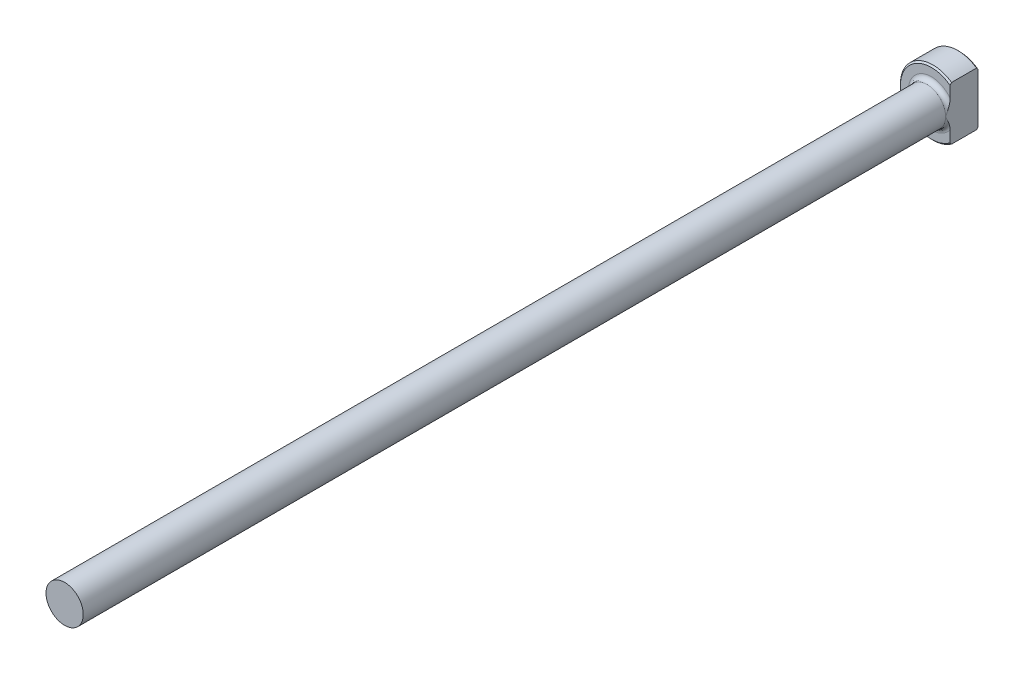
from build123d import *

# Parameters (mm, degrees)
CUT_EXTRUDE2_START = 7.62
CUT_EXTRUDE2_DEPTH = 7.62
CHAMFER1_SIZE      = 0.254


with BuildPart() as part:
    # Sketch2 → Revolve1 (revolve)
    with BuildSketch(Plane(origin=(0, 0, 0), x_dir=(0, 0, 1), z_dir=(1, 0, 0)), mode=Mode.PRIVATE) as revolve1_sk:
        with BuildLine():
            Line((152.4, 0), (0, 0))
            Line((0, 0), (0, 5.5499))
            Line((0, 5.5499), (4.7498, 5.5499))
            Line((4.7498, 5.5499), (4.7498, 3.937))
            ThreePointArc((4.7498, 3.937), (4.972984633, 3.398184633), (5.5118, 3.175))
            Line((5.5118, 3.175), (152.4, 3.175))
            Line((152.4, 3.175), (152.4, 0))
        make_face()
    revolve(revolve1_sk.sketch.rotate(Axis((0, 0, -2.147539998), (0, 0, 1)), 270), axis=Axis((0, 0, -2.147539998), (0, 0, 1)))

    # Sketch4 → Cut-Extrude2 (cut)
    with BuildSketch(Plane.XY.offset(CUT_EXTRUDE2_START)):
        with BuildLine():
            Line((3.175, 4.552006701), (3.175, -4.552006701))
            ThreePointArc((3.175, -4.552006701), (5.5499, 0), (3.175, 4.552006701))
        make_face()
    extrude(amount=-CUT_EXTRUDE2_DEPTH, mode=Mode.SUBTRACT)

    # Chamfer1
    chamfer1_edges = [part.edges().sort_by_distance(p)[0] for p in [
        (-5.5499, 0, 4.7498),
        (-5.5499, 0, 0),
    ]]
    chamfer(chamfer1_edges, length=CHAMFER1_SIZE)


solid = part.part
